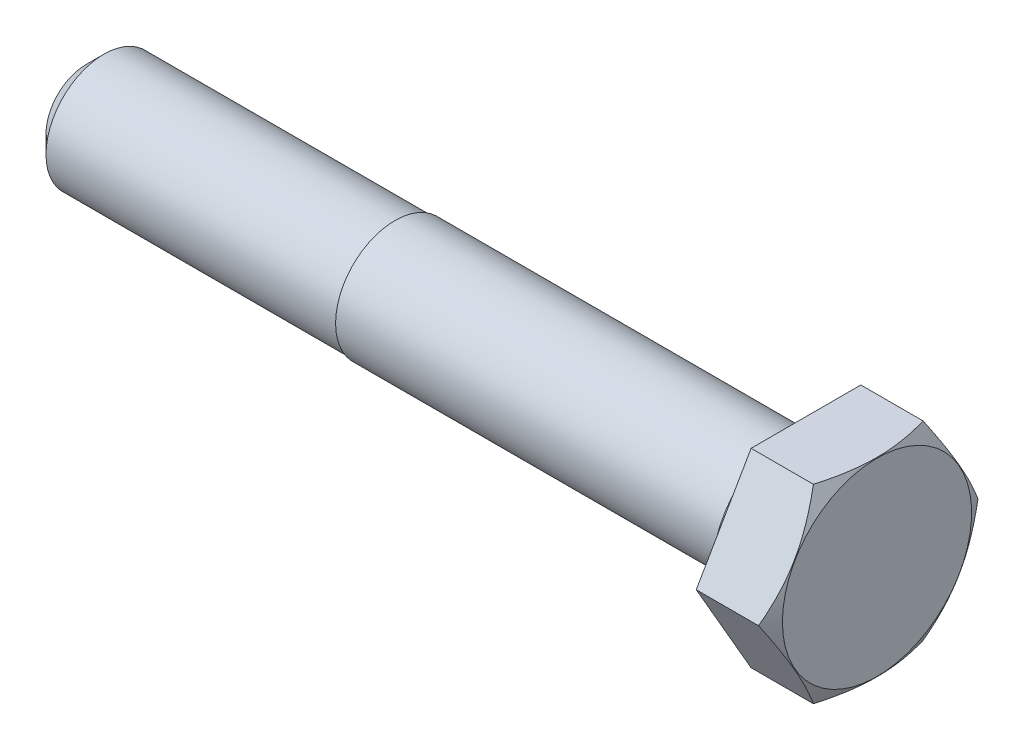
ISO-10303-21;
HEADER;
FILE_DESCRIPTION(('STEP AP214'),'2;1');
FILE_NAME('part.step','',(''),(''),'','','');
FILE_SCHEMA(('AUTOMOTIVE_DESIGN { 1 0 10303 214 1 1 1 1 }'));
ENDSEC;
DATA;
#1=APPLICATION_CONTEXT('core data for automotive mechanical design processes');
#2=APPLICATION_PROTOCOL_DEFINITION('international standard','automotive_design',2000,#1);
#3=PRODUCT_CONTEXT('',#1,'mechanical');
#4=PRODUCT('Part','Part','',(#3));
#5=PRODUCT_RELATED_PRODUCT_CATEGORY('part','',(#4));
#6=PRODUCT_DEFINITION_FORMATION('','',#4);
#7=PRODUCT_DEFINITION_CONTEXT('part definition',#1,'design');
#8=PRODUCT_DEFINITION('design','',#6,#7);
#9=PRODUCT_DEFINITION_SHAPE('','',#8);
#10=(LENGTH_UNIT() NAMED_UNIT(*) SI_UNIT(.MILLI.,.METRE.));
#11=(NAMED_UNIT(*) PLANE_ANGLE_UNIT() SI_UNIT($,.RADIAN.));
#12=(NAMED_UNIT(*) SI_UNIT($,.STERADIAN.) SOLID_ANGLE_UNIT());
#13=UNCERTAINTY_MEASURE_WITH_UNIT(LENGTH_MEASURE(1.E-05),#10,'distance_accuracy_value','');
#14=(GEOMETRIC_REPRESENTATION_CONTEXT(3) GLOBAL_UNCERTAINTY_ASSIGNED_CONTEXT((#13)) GLOBAL_UNIT_ASSIGNED_CONTEXT((#10,
#11,#12)) REPRESENTATION_CONTEXT('',''));
#15=CARTESIAN_POINT('',(0.,0.,0.));
#16=DIRECTION('',(0.,0.,1.));
#17=DIRECTION('',(1.,0.,0.));
#18=AXIS2_PLACEMENT_3D('',#15,#16,#17);
#19=CARTESIAN_POINT('',(6.58,0.,0.));
#20=DIRECTION('',(1.,0.,0.));
#21=DIRECTION('',(0.,0.,-1.));
#22=AXIS2_PLACEMENT_3D('',#19,#20,#21);
#23=PLANE('',#22);
#24=CARTESIAN_POINT('',(6.58000000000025,0.,0.));
#25=DIRECTION('',(-1.,0.,0.));
#26=DIRECTION('',(0.,0.,1.));
#27=AXIS2_PLACEMENT_3D('',#24,#25,#26);
#28=CIRCLE('',#27,7.96416127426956);
#29=CARTESIAN_POINT('',(6.58000000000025,0.,7.96416127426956));
#30=VERTEX_POINT('',#29);
#31=EDGE_CURVE('E96',#30,#30,#28,.T.);
#32=ORIENTED_EDGE('',*,*,#31,.F.);
#33=EDGE_LOOP('',(#32));
#34=FACE_BOUND('',#33,.T.);
#35=ADVANCED_FACE('F16',(#34),#23,.T.);
#36=CARTESIAN_POINT('',(5.84036598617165,0.,0.));
#37=DIRECTION('',(-1.,0.,0.));
#38=DIRECTION('',(0.,0.,1.));
#39=AXIS2_PLACEMENT_3D('',#36,#37,#38);
#40=CONICAL_SURFACE('',#39,9.24524496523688,1.0471975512);
#41=ORIENTED_EDGE('',*,*,#31,.T.);
#42=EDGE_LOOP('',(#41));
#43=FACE_BOUND('',#42,.T.);
#44=CARTESIAN_POINT('',(5.84477732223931,-1.71278036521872E-12,-9.23760430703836));
#45=CARTESIAN_POINT('',(5.94979165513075,-0.315055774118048,-9.05570677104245));
#46=CARTESIAN_POINT('',(6.04630304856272,-0.632460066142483,-8.87245331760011));
#47=CARTESIAN_POINT('',(6.21805198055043,-1.27221617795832,-8.50308995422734));
#48=CARTESIAN_POINT('',(6.29324487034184,-1.59457691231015,-8.31697489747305));
#49=CARTESIAN_POINT('',(6.41622401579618,-2.2359286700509,-7.946690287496));
#50=CARTESIAN_POINT('',(6.46458569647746,-2.5548337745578,-7.76257033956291));
#51=CARTESIAN_POINT('',(6.51588451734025,-3.03469904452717,-7.48551999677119));
#52=CARTESIAN_POINT('',(6.52944237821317,-3.19484385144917,-7.39306034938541));
#53=CARTESIAN_POINT('',(6.5492482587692,-3.51546832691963,-7.20794772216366));
#54=CARTESIAN_POINT('',(6.55549683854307,-3.67594796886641,-7.11529475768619));
#55=CARTESIAN_POINT('',(6.56075664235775,-4.0103014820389,-6.92225566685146));
#56=CARTESIAN_POINT('',(6.55912510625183,-4.18418310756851,-6.82186506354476));
#57=CARTESIAN_POINT('',(6.54717075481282,-4.53172322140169,-6.62121268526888));
#58=CARTESIAN_POINT('',(6.53684775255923,-4.70538170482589,-6.5209509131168));
#59=CARTESIAN_POINT('',(6.50774077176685,-5.05235452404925,-6.32062606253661));
#60=CARTESIAN_POINT('',(6.48894759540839,-5.22566827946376,-6.22056331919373));
#61=CARTESIAN_POINT('',(6.44332878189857,-5.57150185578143,-6.0208962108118));
#62=CARTESIAN_POINT('',(6.41650247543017,-5.74402160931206,-5.92129188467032));
#63=CARTESIAN_POINT('',(6.32328511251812,-6.26854051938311,-5.6184607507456));
#64=CARTESIAN_POINT('',(6.24490938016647,-6.61898300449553,-5.41613268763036));
#65=CARTESIAN_POINT('',(6.10811478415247,-7.14030011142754,-5.11515011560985));
#66=CARTESIAN_POINT('',(6.05937070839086,-7.31317449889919,-5.01534104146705));
#67=CARTESIAN_POINT('',(5.95617990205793,-7.65757214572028,-4.81650296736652));
#68=CARTESIAN_POINT('',(5.90173542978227,-7.82909591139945,-4.71747367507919));
#69=CARTESIAN_POINT('',(5.84477732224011,-8.00000000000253,-4.61880215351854));
#70=B_SPLINE_CURVE_WITH_KNOTS('',3,(#44,#45,#46,#47,#48,#49,#50,#51,#52,#53,#54,#55,#56,#57,#58,
#59,#60,#61,#62,#63,#64,#65,#66,#67,#68,#69),.UNSPECIFIED.,.F.,.F.,(4,2,2,2,2,2,2,2,2,2,2,2,4),
(0.,1.13620772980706,2.2747778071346,3.38787966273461,3.94400525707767,4.50008823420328,
5.10225977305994,5.70444426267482,6.30728424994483,6.910174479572,8.14546238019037,
8.76185434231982,9.37800302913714),.UNSPECIFIED.);
#71=CARTESIAN_POINT('',(5.84477732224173,-8.53704943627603E-13,-9.23760430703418));
#72=VERTEX_POINT('',#71);
#73=CARTESIAN_POINT('',(5.84477732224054,-8.,-4.61880215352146));
#74=VERTEX_POINT('',#73);
#75=EDGE_CURVE('E137',#72,#74,#70,.T.);
#76=ORIENTED_EDGE('',*,*,#75,.F.);
#77=CARTESIAN_POINT('',(5.84477732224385,7.99999999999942,-4.61880215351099));
#78=CARTESIAN_POINT('',(5.90338169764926,7.82415290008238,-4.72032752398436));
#79=CARTESIAN_POINT('',(5.95932618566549,7.64765018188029,-4.82223141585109));
#80=CARTESIAN_POINT('',(6.06516280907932,7.29321133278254,-5.02686678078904));
#81=CARTESIAN_POINT('',(6.11505233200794,7.11527461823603,-5.12959859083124));
#82=CARTESIAN_POINT('',(6.25465902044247,6.57861566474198,-5.43943878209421));
#83=CARTESIAN_POINT('',(6.33406438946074,6.21777505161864,-5.64777020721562));
#84=CARTESIAN_POINT('',(6.42717459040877,5.67778408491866,-5.95953413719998));
#85=CARTESIAN_POINT('',(6.45369860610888,5.50024680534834,-6.06203533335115));
#86=CARTESIAN_POINT('',(6.4981739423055,5.14436946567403,-6.2675012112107));
#87=CARTESIAN_POINT('',(6.51612602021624,4.96602947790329,-6.37046585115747));
#88=CARTESIAN_POINT('',(6.54300251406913,4.60904251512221,-6.57657237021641));
#89=CARTESIAN_POINT('',(6.55193717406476,4.43039611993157,-6.67971391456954));
#90=CARTESIAN_POINT('',(6.56058729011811,4.0729384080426,-6.88609222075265));
#91=CARTESIAN_POINT('',(6.56030303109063,3.89412709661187,-6.98932897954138));
#92=CARTESIAN_POINT('',(6.55115729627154,3.55984569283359,-7.18232643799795));
#93=CARTESIAN_POINT('',(6.54341147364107,3.40435198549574,-7.2721007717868));
#94=CARTESIAN_POINT('',(6.52109880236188,3.09372877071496,-7.45143916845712));
#95=CARTESIAN_POINT('',(6.50653149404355,2.93859928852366,-7.54100321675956));
#96=CARTESIAN_POINT('',(6.45294161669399,2.47381144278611,-7.80934860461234));
#97=CARTESIAN_POINT('',(6.40403778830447,2.16497575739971,-7.98765497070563));
#98=CARTESIAN_POINT('',(6.28177990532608,1.54402881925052,-8.34615885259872));
#99=CARTESIAN_POINT('',(6.20790770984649,1.23199679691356,-8.52631062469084));
#100=CARTESIAN_POINT('',(6.0402493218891,0.612585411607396,-8.88392795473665));
#101=CARTESIAN_POINT('',(5.94650249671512,0.3051981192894,-9.06139809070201));
#102=CARTESIAN_POINT('',(5.84477732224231,-5.49950815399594E-12,-9.23760430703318));
#103=B_SPLINE_CURVE_WITH_KNOTS('',3,(#77,#78,#79,#80,#81,#82,#83,#84,#85,#86,#87,#88,#89,#90,
#91,#92,#93,#94,#95,#96,#97,#98,#99,#100,#101,#102),.UNSPECIFIED.,.F.,.F.,(4,2,2,2,2,2,2,2,2,2,
2,2,4),(0.,0.633965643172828,1.26820385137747,2.5393150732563,3.15930423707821,3.77923860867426,
4.39846792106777,5.01767809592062,5.55669078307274,6.09573979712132,7.17460544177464,
8.27739515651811,9.37802056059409),.UNSPECIFIED.);
#104=CARTESIAN_POINT('',(5.84477732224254,7.99999999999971,-4.61880215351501));
#105=VERTEX_POINT('',#104);
#106=EDGE_CURVE('E92',#105,#72,#103,.T.);
#107=ORIENTED_EDGE('',*,*,#106,.F.);
#108=CARTESIAN_POINT('',(5.84477732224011,8.,4.61880215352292));
#109=CARTESIAN_POINT('',(5.90338169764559,8.,4.41575141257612));
#110=CARTESIAN_POINT('',(5.95932618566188,8.,4.21194362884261));
#111=CARTESIAN_POINT('',(6.06516280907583,8.,3.8026728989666));
#112=CARTESIAN_POINT('',(6.11505233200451,8.,3.59720927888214));
#113=CARTESIAN_POINT('',(6.25465902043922,8.,2.97752889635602));
#114=CARTESIAN_POINT('',(6.33406438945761,8.,2.56086604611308));
#115=CARTESIAN_POINT('',(6.4271745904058,8.,1.93733818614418));
#116=CARTESIAN_POINT('',(6.45369860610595,8.,1.73233579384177));
#117=CARTESIAN_POINT('',(6.49817394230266,8.,1.32140403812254));
#118=CARTESIAN_POINT('',(6.51612602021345,8.,1.11547475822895));
#119=CARTESIAN_POINT('',(6.54300251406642,8.,0.703261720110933));
#120=CARTESIAN_POINT('',(6.55193717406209,8.,0.496978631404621));
#121=CARTESIAN_POINT('',(6.5605872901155,8.,0.0842220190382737));
#122=CARTESIAN_POINT('',(6.56030303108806,8.,-0.12225149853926));
#123=CARTESIAN_POINT('',(6.55115729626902,8.,-0.508246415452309));
#124=CARTESIAN_POINT('',(6.54341147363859,8.,-0.687795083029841));
#125=CARTESIAN_POINT('',(6.52109880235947,8.,-1.04647187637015));
#126=CARTESIAN_POINT('',(6.50653149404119,8.,-1.22559997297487));
#127=CARTESIAN_POINT('',(6.45294161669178,8.,-1.76229074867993));
#128=CARTESIAN_POINT('',(6.40403778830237,8.,-2.11890348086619));
#129=CARTESIAN_POINT('',(6.28177990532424,8.,-2.83591124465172));
#130=CARTESIAN_POINT('',(6.2079077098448,8.,-3.19621478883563));
#131=CARTESIAN_POINT('',(6.04024932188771,8.,-3.91144944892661));
#132=CARTESIAN_POINT('',(5.94650249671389,8.,-4.26638972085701));
#133=CARTESIAN_POINT('',(5.84477732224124,8.,-4.61880215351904));
#134=B_SPLINE_CURVE_WITH_KNOTS('',3,(#108,#109,#110,#111,#112,#113,#114,#115,#116,#117,#118,
#119,#120,#121,#122,#123,#124,#125,#126,#127,#128,#129,#130,#131,#132,#133),.UNSPECIFIED.,.F.,
.F.,(4,2,2,2,2,2,2,2,2,2,2,2,4),(0.,0.633965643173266,1.26820385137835,2.53931507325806,
3.15930423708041,3.77923860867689,4.39846792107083,5.01767809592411,5.55669078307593,
6.09573979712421,7.17460544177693,8.27739515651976,9.3780205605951),.UNSPECIFIED.);
#135=CARTESIAN_POINT('',(5.84477732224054,8.,4.61880215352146));
#136=VERTEX_POINT('',#135);
#137=EDGE_CURVE('E85',#136,#105,#134,.T.);
#138=ORIENTED_EDGE('',*,*,#137,.F.);
#139=CARTESIAN_POINT('',(5.84477732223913,1.15719547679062E-12,9.23760430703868));
#140=CARTESIAN_POINT('',(5.94979165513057,0.315055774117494,9.05570677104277));
#141=CARTESIAN_POINT('',(6.04630304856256,0.632460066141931,8.87245331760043));
#142=CARTESIAN_POINT('',(6.2180519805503,1.27221617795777,8.50308995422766));
#143=CARTESIAN_POINT('',(6.29324487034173,1.59457691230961,8.31697489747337));
#144=CARTESIAN_POINT('',(6.41622401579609,2.23592867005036,7.94669028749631));
#145=CARTESIAN_POINT('',(6.46458569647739,2.55483377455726,7.76257033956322));
#146=CARTESIAN_POINT('',(6.5158845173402,3.03469904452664,7.4855199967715));
#147=CARTESIAN_POINT('',(6.52944237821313,3.19484385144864,7.39306034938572));
#148=CARTESIAN_POINT('',(6.54924825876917,3.51546832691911,7.20794772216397));
#149=CARTESIAN_POINT('',(6.55549683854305,3.67594796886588,7.1152947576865));
#150=CARTESIAN_POINT('',(6.56075664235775,4.0103014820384,6.92225566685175));
#151=CARTESIAN_POINT('',(6.55912510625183,4.18418310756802,6.82186506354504));
#152=CARTESIAN_POINT('',(6.54717075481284,4.53172322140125,6.62121268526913));
#153=CARTESIAN_POINT('',(6.53684775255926,4.70538170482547,6.52095091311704));
#154=CARTESIAN_POINT('',(6.50774077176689,5.05235452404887,6.32062606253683));
#155=CARTESIAN_POINT('',(6.48894759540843,5.2256682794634,6.22056331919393));
#156=CARTESIAN_POINT('',(6.44332878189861,5.57150185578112,6.02089621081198));
#157=CARTESIAN_POINT('',(6.41650247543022,5.74402160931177,5.92129188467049));
#158=CARTESIAN_POINT('',(6.32328511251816,6.26854051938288,5.61846075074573));
#159=CARTESIAN_POINT('',(6.24490938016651,6.61898300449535,5.41613268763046));
#160=CARTESIAN_POINT('',(6.1081147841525,7.14030011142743,5.11515011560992));
#161=CARTESIAN_POINT('',(6.05937070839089,7.31317449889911,5.0153410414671));
#162=CARTESIAN_POINT('',(5.95617990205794,7.65757214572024,4.81650296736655));
#163=CARTESIAN_POINT('',(5.90173542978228,7.82909591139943,4.7174736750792));
#164=CARTESIAN_POINT('',(5.84477732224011,8.00000000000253,4.61880215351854));
#165=B_SPLINE_CURVE_WITH_KNOTS('',3,(#139,#140,#141,#142,#143,#144,#145,#146,#147,#148,#149,
#150,#151,#152,#153,#154,#155,#156,#157,#158,#159,#160,#161,#162,#163,#164),.UNSPECIFIED.,.F.,
.F.,(4,2,2,2,2,2,2,2,2,2,2,2,4),(0.,1.13620772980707,2.27477780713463,3.38787966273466,
3.94400525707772,4.50008823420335,5.10225977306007,5.70444426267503,6.30728424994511,
6.91017447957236,8.14546238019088,8.76185434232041,9.37800302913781),.UNSPECIFIED.);
#166=CARTESIAN_POINT('',(5.84477732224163,5.7958640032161E-13,9.23760430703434));
#167=VERTEX_POINT('',#166);
#168=EDGE_CURVE('E89',#167,#136,#165,.T.);
#169=ORIENTED_EDGE('',*,*,#168,.F.);
#170=CARTESIAN_POINT('',(5.84477732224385,-7.99999999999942,4.61880215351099));
#171=CARTESIAN_POINT('',(5.90338169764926,-7.82415290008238,4.72032752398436));
#172=CARTESIAN_POINT('',(5.95932618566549,-7.64765018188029,4.82223141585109));
#173=CARTESIAN_POINT('',(6.06516280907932,-7.29321133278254,5.02686678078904));
#174=CARTESIAN_POINT('',(6.11505233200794,-7.11527461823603,5.12959859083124));
#175=CARTESIAN_POINT('',(6.25465902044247,-6.57861566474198,5.43943878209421));
#176=CARTESIAN_POINT('',(6.33406438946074,-6.21777505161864,5.64777020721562));
#177=CARTESIAN_POINT('',(6.42717459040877,-5.67778408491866,5.95953413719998));
#178=CARTESIAN_POINT('',(6.45369860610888,-5.50024680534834,6.06203533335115));
#179=CARTESIAN_POINT('',(6.4981739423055,-5.14436946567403,6.2675012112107));
#180=CARTESIAN_POINT('',(6.51612602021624,-4.96602947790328,6.37046585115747));
#181=CARTESIAN_POINT('',(6.54300251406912,-4.60904251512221,6.57657237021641));
#182=CARTESIAN_POINT('',(6.55193717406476,-4.43039611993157,6.67971391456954));
#183=CARTESIAN_POINT('',(6.56058729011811,-4.0729384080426,6.88609222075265));
#184=CARTESIAN_POINT('',(6.56030303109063,-3.89412709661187,6.98932897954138));
#185=CARTESIAN_POINT('',(6.55115729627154,-3.55984569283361,7.18232643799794));
#186=CARTESIAN_POINT('',(6.54341147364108,-3.40435198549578,7.27210077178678));
#187=CARTESIAN_POINT('',(6.52109880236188,-3.09372877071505,7.45143916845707));
#188=CARTESIAN_POINT('',(6.50653149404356,-2.93859928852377,7.5410032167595));
#189=CARTESIAN_POINT('',(6.45294161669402,-2.4738114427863,7.80934860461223));
#190=CARTESIAN_POINT('',(6.40403778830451,-2.16497575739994,7.9876549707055));
#191=CARTESIAN_POINT('',(6.28177990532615,-1.54402881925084,8.34615885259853));
#192=CARTESIAN_POINT('',(6.20790770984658,-1.23199679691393,8.52631062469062));
#193=CARTESIAN_POINT('',(6.04024932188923,-0.612585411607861,8.88392795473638));
#194=CARTESIAN_POINT('',(5.94650249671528,-0.305198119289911,9.06139809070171));
#195=CARTESIAN_POINT('',(5.84477732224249,4.94435617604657E-12,9.23760430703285));
#196=B_SPLINE_CURVE_WITH_KNOTS('',3,(#170,#171,#172,#173,#174,#175,#176,#177,#178,#179,#180,
#181,#182,#183,#184,#185,#186,#187,#188,#189,#190,#191,#192,#193,#194,#195),.UNSPECIFIED.,.F.,
.F.,(4,2,2,2,2,2,2,2,2,2,2,2,4),(0.,0.633965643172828,1.26820385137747,2.5393150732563,
3.15930423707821,3.77923860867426,4.39846792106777,5.01767809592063,5.55669078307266,
6.09573979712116,7.17460544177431,8.27739515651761,9.37802056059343),.UNSPECIFIED.);
#197=CARTESIAN_POINT('',(5.8447773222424,-7.99999999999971,4.6188021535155));
#198=VERTEX_POINT('',#197);
#199=EDGE_CURVE('E110',#198,#167,#196,.T.);
#200=ORIENTED_EDGE('',*,*,#199,.F.);
#201=CARTESIAN_POINT('',(5.84477732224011,-8.,-4.61880215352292));
#202=CARTESIAN_POINT('',(5.90338169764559,-8.,-4.41575141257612));
#203=CARTESIAN_POINT('',(5.95932618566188,-8.,-4.21194362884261));
#204=CARTESIAN_POINT('',(6.06516280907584,-8.,-3.8026728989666));
#205=CARTESIAN_POINT('',(6.11505233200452,-8.,-3.59720927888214));
#206=CARTESIAN_POINT('',(6.25465902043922,-8.,-2.97752889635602));
#207=CARTESIAN_POINT('',(6.33406438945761,-8.,-2.56086604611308));
#208=CARTESIAN_POINT('',(6.4271745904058,-8.,-1.93733818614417));
#209=CARTESIAN_POINT('',(6.45369860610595,-8.,-1.73233579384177));
#210=CARTESIAN_POINT('',(6.49817394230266,-8.,-1.32140403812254));
#211=CARTESIAN_POINT('',(6.51612602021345,-8.,-1.11547475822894));
#212=CARTESIAN_POINT('',(6.54300251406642,-8.,-0.703261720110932));
#213=CARTESIAN_POINT('',(6.55193717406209,-8.,-0.49697863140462));
#214=CARTESIAN_POINT('',(6.5605872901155,-8.,-0.0842220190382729));
#215=CARTESIAN_POINT('',(6.56030303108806,-8.,0.122251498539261));
#216=CARTESIAN_POINT('',(6.55115729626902,-8.,0.508246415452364));
#217=CARTESIAN_POINT('',(6.54341147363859,-8.,0.687795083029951));
#218=CARTESIAN_POINT('',(6.52109880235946,-8.,1.04647187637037));
#219=CARTESIAN_POINT('',(6.50653149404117,-8.,1.22559997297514));
#220=CARTESIAN_POINT('',(6.45294161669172,-8.,1.76229074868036));
#221=CARTESIAN_POINT('',(6.4040377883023,-8.,2.11890348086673));
#222=CARTESIAN_POINT('',(6.2817799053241,-8.,2.83591124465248));
#223=CARTESIAN_POINT('',(6.20790770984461,-8.,3.1962147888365));
#224=CARTESIAN_POINT('',(6.04024932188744,-8.,3.9114494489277));
#225=CARTESIAN_POINT('',(5.94650249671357,-8.,4.2663897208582));
#226=CARTESIAN_POINT('',(5.84477732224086,-8.,4.61880215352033));
#227=B_SPLINE_CURVE_WITH_KNOTS('',3,(#201,#202,#203,#204,#205,#206,#207,#208,#209,#210,#211,
#212,#213,#214,#215,#216,#217,#218,#219,#220,#221,#222,#223,#224,#225,#226),.UNSPECIFIED.,.F.,
.F.,(4,2,2,2,2,2,2,2,2,2,2,2,4),(0.,0.633965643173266,1.26820385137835,2.53931507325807,
3.15930423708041,3.77923860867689,4.39846792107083,5.01767809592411,5.55669078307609,
6.09573979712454,7.17460544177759,8.27739515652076,9.37802056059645),.UNSPECIFIED.);
#228=EDGE_CURVE('E144',#74,#198,#227,.T.);
#229=ORIENTED_EDGE('',*,*,#228,.F.);
#230=EDGE_LOOP('',(#76,#107,#138,#169,#200,#229));
#231=FACE_BOUND('',#230,.T.);
#232=ADVANCED_FACE('F87',(#43,#231),#40,.T.);
#233=CARTESIAN_POINT('',(0.6,8.,-4.61880215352));
#234=DIRECTION('',(0.,1.,0.));
#235=DIRECTION('',(0.,0.,1.));
#236=AXIS2_PLACEMENT_3D('',#233,#234,#235);
#237=PLANE('',#236);
#238=DIRECTION('',(1.,0.,0.));
#239=VECTOR('',#238,1.);
#240=CARTESIAN_POINT('',(0.6,8.,4.61880215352));
#241=LINE('',#240,#239);
#242=CARTESIAN_POINT('',(0.6,8.,4.61880215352));
#243=VERTEX_POINT('',#242);
#244=EDGE_CURVE('E95',#136,#243,#241,.F.);
#245=ORIENTED_EDGE('',*,*,#244,.F.);
#246=ORIENTED_EDGE('',*,*,#137,.T.);
#247=DIRECTION('',(1.,0.,0.));
#248=VECTOR('',#247,1.);
#249=CARTESIAN_POINT('',(0.6,7.99999999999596,-4.61880215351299));
#250=LINE('',#249,#248);
#251=CARTESIAN_POINT('',(0.6,7.99999999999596,-4.61880215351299));
#252=VERTEX_POINT('',#251);
#253=EDGE_CURVE('E154',#252,#105,#250,.T.);
#254=ORIENTED_EDGE('',*,*,#253,.F.);
#255=DIRECTION('',(0.,0.,-1.));
#256=VECTOR('',#255,1.);
#257=CARTESIAN_POINT('',(0.6,8.,0.));
#258=LINE('',#257,#256);
#259=EDGE_CURVE('E101',#252,#243,#258,.F.);
#260=ORIENTED_EDGE('',*,*,#259,.T.);
#261=EDGE_LOOP('',(#245,#246,#254,#260));
#262=FACE_BOUND('',#261,.T.);
#263=ADVANCED_FACE('F99',(#262),#237,.T.);
#264=CARTESIAN_POINT('',(0.6,8.,4.61880215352));
#265=DIRECTION('',(0.,0.50000000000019,0.866025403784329));
#266=DIRECTION('',(0.,-0.866025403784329,0.50000000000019));
#267=AXIS2_PLACEMENT_3D('',#264,#265,#266);
#268=PLANE('',#267);
#269=DIRECTION('',(1.,0.,0.));
#270=VECTOR('',#269,1.);
#271=CARTESIAN_POINT('',(0.6,0.,9.23760430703));
#272=LINE('',#271,#270);
#273=CARTESIAN_POINT('',(0.6,1.51894184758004E-12,9.23760430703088));
#274=VERTEX_POINT('',#273);
#275=EDGE_CURVE('E107',#167,#274,#272,.F.);
#276=ORIENTED_EDGE('',*,*,#275,.F.);
#277=ORIENTED_EDGE('',*,*,#168,.T.);
#278=ORIENTED_EDGE('',*,*,#244,.T.);
#279=DIRECTION('',(0.,-0.866025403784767,0.499999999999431));
#280=VECTOR('',#279,1.);
#281=CARTESIAN_POINT('',(0.6,8.,4.61880215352));
#282=LINE('',#281,#280);
#283=EDGE_CURVE('E287',#243,#274,#282,.T.);
#284=ORIENTED_EDGE('',*,*,#283,.T.);
#285=EDGE_LOOP('',(#276,#277,#278,#284));
#286=FACE_BOUND('',#285,.T.);
#287=ADVANCED_FACE('F105',(#286),#268,.T.);
#288=CARTESIAN_POINT('',(0.6,0.,9.23760430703));
#289=DIRECTION('',(0.,-0.50000000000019,0.866025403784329));
#290=DIRECTION('',(0.,-0.866025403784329,-0.50000000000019));
#291=AXIS2_PLACEMENT_3D('',#288,#289,#290);
#292=PLANE('',#291);
#293=DIRECTION('',(1.,0.,0.));
#294=VECTOR('',#293,1.);
#295=CARTESIAN_POINT('',(0.6,-8.,4.61880215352));
#296=LINE('',#295,#294);
#297=CARTESIAN_POINT('',(0.6,-8.,4.61880215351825));
#298=VERTEX_POINT('',#297);
#299=EDGE_CURVE('E271',#198,#298,#296,.F.);
#300=ORIENTED_EDGE('',*,*,#299,.F.);
#301=ORIENTED_EDGE('',*,*,#199,.T.);
#302=ORIENTED_EDGE('',*,*,#275,.T.);
#303=DIRECTION('',(0.,-0.866025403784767,-0.499999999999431));
#304=VECTOR('',#303,1.);
#305=CARTESIAN_POINT('',(0.6,0.,9.23760430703));
#306=LINE('',#305,#304);
#307=EDGE_CURVE('E295',#274,#298,#306,.T.);
#308=ORIENTED_EDGE('',*,*,#307,.T.);
#309=EDGE_LOOP('',(#300,#301,#302,#308));
#310=FACE_BOUND('',#309,.T.);
#311=ADVANCED_FACE('F171',(#310),#292,.T.);
#312=CARTESIAN_POINT('',(0.6,-8.,4.61880215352));
#313=DIRECTION('',(0.,-1.,0.));
#314=DIRECTION('',(0.,0.,-1.));
#315=AXIS2_PLACEMENT_3D('',#312,#313,#314);
#316=PLANE('',#315);
#317=DIRECTION('',(1.,0.,0.));
#318=VECTOR('',#317,1.);
#319=CARTESIAN_POINT('',(0.6,-8.,-4.61880215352));
#320=LINE('',#319,#318);
#321=CARTESIAN_POINT('',(0.6,-8.,-4.61880215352));
#322=VERTEX_POINT('',#321);
#323=EDGE_CURVE('E266',#74,#322,#320,.F.);
#324=ORIENTED_EDGE('',*,*,#323,.F.);
#325=ORIENTED_EDGE('',*,*,#228,.T.);
#326=ORIENTED_EDGE('',*,*,#299,.T.);
#327=DIRECTION('',(0.,0.,-1.));
#328=VECTOR('',#327,1.);
#329=CARTESIAN_POINT('',(0.6,-8.,0.));
#330=LINE('',#329,#328);
#331=EDGE_CURVE('E291',#298,#322,#330,.T.);
#332=ORIENTED_EDGE('',*,*,#331,.T.);
#333=EDGE_LOOP('',(#324,#325,#326,#332));
#334=FACE_BOUND('',#333,.T.);
#335=ADVANCED_FACE('F167',(#334),#316,.T.);
#336=CARTESIAN_POINT('',(0.6,-8.,-4.61880215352));
#337=DIRECTION('',(0.,-0.50000000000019,-0.866025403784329));
#338=DIRECTION('',(0.,0.866025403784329,-0.50000000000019));
#339=AXIS2_PLACEMENT_3D('',#336,#337,#338);
#340=PLANE('',#339);
#341=DIRECTION('',(1.,0.,0.));
#342=VECTOR('',#341,1.);
#343=CARTESIAN_POINT('',(0.6,0.,-9.23760430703));
#344=LINE('',#343,#342);
#345=CARTESIAN_POINT('',(0.6,-1.51257229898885E-12,-9.23760430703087));
#346=VERTEX_POINT('',#345);
#347=EDGE_CURVE('E259',#72,#346,#344,.F.);
#348=ORIENTED_EDGE('',*,*,#347,.F.);
#349=ORIENTED_EDGE('',*,*,#75,.T.);
#350=ORIENTED_EDGE('',*,*,#323,.T.);
#351=DIRECTION('',(0.,0.866025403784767,-0.499999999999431));
#352=VECTOR('',#351,1.);
#353=CARTESIAN_POINT('',(0.6,-8.,-4.61880215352));
#354=LINE('',#353,#352);
#355=EDGE_CURVE('E283',#322,#346,#354,.T.);
#356=ORIENTED_EDGE('',*,*,#355,.T.);
#357=EDGE_LOOP('',(#348,#349,#350,#356));
#358=FACE_BOUND('',#357,.T.);
#359=ADVANCED_FACE('F162',(#358),#340,.T.);
#360=CARTESIAN_POINT('',(0.6,0.,-9.23760430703));
#361=DIRECTION('',(0.,0.50000000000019,-0.866025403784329));
#362=DIRECTION('',(0.,0.866025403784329,0.50000000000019));
#363=AXIS2_PLACEMENT_3D('',#360,#361,#362);
#364=PLANE('',#363);
#365=ORIENTED_EDGE('',*,*,#253,.T.);
#366=ORIENTED_EDGE('',*,*,#106,.T.);
#367=ORIENTED_EDGE('',*,*,#347,.T.);
#368=DIRECTION('',(0.,0.866025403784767,0.499999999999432));
#369=VECTOR('',#368,1.);
#370=CARTESIAN_POINT('',(0.6,0.,-9.23760430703));
#371=LINE('',#370,#369);
#372=EDGE_CURVE('E280',#346,#252,#371,.T.);
#373=ORIENTED_EDGE('',*,*,#372,.T.);
#374=EDGE_LOOP('',(#365,#366,#367,#373));
#375=FACE_BOUND('',#374,.T.);
#376=ADVANCED_FACE('F157',(#375),#364,.T.);
#377=CARTESIAN_POINT('',(-60.,0.,0.));
#378=DIRECTION('',(-1.,0.,0.));
#379=DIRECTION('',(0.,0.,1.));
#380=AXIS2_PLACEMENT_3D('',#377,#378,#379);
#381=PLANE('',#380);
#382=CARTESIAN_POINT('',(-59.9999999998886,0.,0.));
#383=DIRECTION('',(1.,0.,0.));
#384=DIRECTION('',(0.,0.,-1.));
#385=AXIS2_PLACEMENT_3D('',#382,#383,#384);
#386=CIRCLE('',#385,3.37804878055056);
#387=CARTESIAN_POINT('',(-59.9999999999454,-3.37804878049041,-1.58731601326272E-11));
#388=VERTEX_POINT('',#387);
#389=CARTESIAN_POINT('',(-59.9999999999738,3.37804878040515,1.40288334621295E-13));
#390=VERTEX_POINT('',#389);
#391=EDGE_CURVE('E250',#388,#390,#386,.T.);
#392=ORIENTED_EDGE('',*,*,#391,.F.);
#393=CARTESIAN_POINT('',(-60.0000000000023,0.,0.));
#394=DIRECTION('',(1.,0.,0.));
#395=DIRECTION('',(0.,0.,-1.));
#396=AXIS2_PLACEMENT_3D('',#393,#394,#395);
#397=CIRCLE('',#396,3.37804878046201);
#398=EDGE_CURVE('E155',#390,#388,#397,.T.);
#399=ORIENTED_EDGE('',*,*,#398,.F.);
#400=EDGE_LOOP('',(#392,#399));
#401=FACE_BOUND('',#400,.T.);
#402=ADVANCED_FACE('F161',(#401),#381,.T.);
#403=CARTESIAN_POINT('',(0.6,0.,0.));
#404=DIRECTION('',(1.,0.,0.));
#405=DIRECTION('',(0.,0.,-1.));
#406=AXIS2_PLACEMENT_3D('',#403,#404,#405);
#407=PLANE('',#406);
#408=CARTESIAN_POINT('',(0.6,0.,0.));
#409=DIRECTION('',(1.,0.,0.));
#410=DIRECTION('',(0.,0.,-1.));
#411=AXIS2_PLACEMENT_3D('',#408,#409,#410);
#412=CIRCLE('',#411,7.315);
#413=CARTESIAN_POINT('',(0.6,0.,-7.315));
#414=VERTEX_POINT('',#413);
#415=EDGE_CURVE('E239',#414,#414,#412,.F.);
#416=ORIENTED_EDGE('',*,*,#415,.F.);
#417=EDGE_LOOP('',(#416));
#418=FACE_BOUND('',#417,.T.);
#419=ORIENTED_EDGE('',*,*,#355,.F.);
#420=ORIENTED_EDGE('',*,*,#331,.F.);
#421=ORIENTED_EDGE('',*,*,#307,.F.);
#422=ORIENTED_EDGE('',*,*,#283,.F.);
#423=ORIENTED_EDGE('',*,*,#259,.F.);
#424=ORIENTED_EDGE('',*,*,#372,.F.);
#425=EDGE_LOOP('',(#419,#420,#421,#422,#423,#424));
#426=FACE_BOUND('',#425,.T.);
#427=ADVANCED_FACE('F384',(#418,#426),#407,.F.);
#428=CARTESIAN_POINT('',(-58.5000000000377,0.,0.));
#429=DIRECTION('',(1.,0.,0.));
#430=DIRECTION('',(0.,0.,-1.));
#431=AXIS2_PLACEMENT_3D('',#428,#429,#430);
#432=CONICAL_SURFACE('',#431,4.87804878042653,0.785398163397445);
#433=DIRECTION('',(-0.707106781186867,-0.707106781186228,1.43621226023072E-12));
#434=VECTOR('',#433,1.);
#435=CARTESIAN_POINT('',(499000.000000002,499063.378048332,-1.01364604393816E-06));
#436=LINE('',#435,#434);
#437=CARTESIAN_POINT('',(-58.4999999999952,4.87804878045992,-1.08970504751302E-12));
#438=VERTEX_POINT('',#437);
#439=EDGE_CURVE('E251',#390,#438,#436,.F.);
#440=ORIENTED_EDGE('',*,*,#439,.F.);
#441=ORIENTED_EDGE('',*,*,#398,.T.);
#442=DIRECTION('',(-0.707106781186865,0.70710678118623,-1.37814759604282E-12));
#443=VECTOR('',#442,1.);
#444=CARTESIAN_POINT('',(499000.000000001,-499063.378048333,9.72649582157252E-07));
#445=LINE('',#444,#443);
#446=CARTESIAN_POINT('',(-58.5000000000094,-4.87804878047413,-3.23808896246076E-12));
#447=VERTEX_POINT('',#446);
#448=EDGE_CURVE('E247',#447,#388,#445,.T.);
#449=ORIENTED_EDGE('',*,*,#448,.F.);
#450=CARTESIAN_POINT('',(-58.5,0.,0.));
#451=DIRECTION('',(-1.,0.,0.));
#452=DIRECTION('',(0.,0.,1.));
#453=AXIS2_PLACEMENT_3D('',#450,#451,#452);
#454=CIRCLE('',#453,4.87804878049);
#455=EDGE_CURVE('E230',#438,#447,#454,.F.);
#456=ORIENTED_EDGE('',*,*,#455,.F.);
#457=EDGE_LOOP('',(#440,#441,#449,#456));
#458=FACE_BOUND('',#457,.T.);
#459=ADVANCED_FACE('F319',(#458),#432,.T.);
#460=CARTESIAN_POINT('',(-58.499999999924,0.,0.));
#461=DIRECTION('',(1.,0.,0.));
#462=DIRECTION('',(0.,0.,-1.));
#463=AXIS2_PLACEMENT_3D('',#460,#461,#462);
#464=CONICAL_SURFACE('',#463,4.8780487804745,0.785398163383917);
#465=ORIENTED_EDGE('',*,*,#448,.T.);
#466=ORIENTED_EDGE('',*,*,#391,.T.);
#467=ORIENTED_EDGE('',*,*,#439,.T.);
#468=CARTESIAN_POINT('',(-58.5,0.,0.));
#469=DIRECTION('',(-1.,0.,0.));
#470=DIRECTION('',(0.,0.,1.));
#471=AXIS2_PLACEMENT_3D('',#468,#469,#470);
#472=CIRCLE('',#471,4.87804878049);
#473=EDGE_CURVE('E238',#447,#438,#472,.F.);
#474=ORIENTED_EDGE('',*,*,#473,.F.);
#475=EDGE_LOOP('',(#465,#466,#467,#474));
#476=FACE_BOUND('',#475,.T.);
#477=ADVANCED_FACE('F314',(#476),#464,.T.);
#478=CARTESIAN_POINT('',(0.3,0.,0.));
#479=DIRECTION('',(1.,0.,0.));
#480=DIRECTION('',(0.,0.,-1.));
#481=AXIS2_PLACEMENT_3D('',#478,#479,#480);
#482=CYLINDRICAL_SURFACE('',#481,7.315);
#483=CARTESIAN_POINT('',(0.,0.,0.));
#484=DIRECTION('',(1.,0.,0.));
#485=DIRECTION('',(0.,0.,-1.));
#486=AXIS2_PLACEMENT_3D('',#483,#484,#485);
#487=CIRCLE('',#486,7.315);
#488=CARTESIAN_POINT('',(0.,0.,-7.315));
#489=VERTEX_POINT('',#488);
#490=EDGE_CURVE('E244',#489,#489,#487,.T.);
#491=ORIENTED_EDGE('',*,*,#490,.T.);
#492=EDGE_LOOP('',(#491));
#493=FACE_BOUND('',#492,.T.);
#494=ORIENTED_EDGE('',*,*,#415,.T.);
#495=EDGE_LOOP('',(#494));
#496=FACE_BOUND('',#495,.T.);
#497=ADVANCED_FACE('F322',(#493,#496),#482,.T.);
#498=CARTESIAN_POINT('',(-47.,0.,0.));
#499=DIRECTION('',(-1.,0.,0.));
#500=DIRECTION('',(0.,0.,1.));
#501=AXIS2_PLACEMENT_3D('',#498,#499,#500);
#502=CYLINDRICAL_SURFACE('',#501,4.87804878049);
#503=CARTESIAN_POINT('',(-34.,0.,0.));
#504=DIRECTION('',(-1.,0.,0.));
#505=DIRECTION('',(0.,0.,1.));
#506=AXIS2_PLACEMENT_3D('',#503,#504,#505);
#507=CIRCLE('',#506,4.87804878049);
#508=CARTESIAN_POINT('',(-34.,0.,4.87804878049));
#509=VERTEX_POINT('',#508);
#510=EDGE_CURVE('E305',#509,#509,#507,.F.);
#511=ORIENTED_EDGE('',*,*,#510,.F.);
#512=EDGE_LOOP('',(#511));
#513=FACE_BOUND('',#512,.T.);
#514=ORIENTED_EDGE('',*,*,#473,.T.);
#515=ORIENTED_EDGE('',*,*,#455,.T.);
#516=EDGE_LOOP('',(#514,#515));
#517=FACE_BOUND('',#516,.T.);
#518=ADVANCED_FACE('F215',(#513,#517),#502,.T.);
#519=CARTESIAN_POINT('',(0.,0.,0.));
#520=DIRECTION('',(1.,0.,0.));
#521=DIRECTION('',(0.,0.,-1.));
#522=AXIS2_PLACEMENT_3D('',#519,#520,#521);
#523=PLANE('',#522);
#524=CARTESIAN_POINT('',(0.,0.,0.));
#525=DIRECTION('',(-1.,0.,0.));
#526=DIRECTION('',(0.,-1.,0.));
#527=AXIS2_PLACEMENT_3D('',#524,#525,#526);
#528=CIRCLE('',#527,5.40000000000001);
#529=CARTESIAN_POINT('',(0.,-5.4,0.));
#530=VERTEX_POINT('',#529);
#531=CARTESIAN_POINT('',(0.,5.40000000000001,0.));
#532=VERTEX_POINT('',#531);
#533=EDGE_CURVE('E35',#530,#532,#528,.T.);
#534=ORIENTED_EDGE('',*,*,#533,.F.);
#535=CARTESIAN_POINT('',(0.,0.,0.));
#536=DIRECTION('',(-1.,0.,0.));
#537=DIRECTION('',(0.,1.,0.));
#538=AXIS2_PLACEMENT_3D('',#535,#536,#537);
#539=CIRCLE('',#538,5.40000000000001);
#540=EDGE_CURVE('E226',#530,#532,#539,.F.);
#541=ORIENTED_EDGE('',*,*,#540,.T.);
#542=EDGE_LOOP('',(#534,#541));
#543=FACE_BOUND('',#542,.T.);
#544=ORIENTED_EDGE('',*,*,#490,.F.);
#545=EDGE_LOOP('',(#544));
#546=FACE_BOUND('',#545,.T.);
#547=ADVANCED_FACE('F206',(#543,#546),#523,.F.);
#548=CARTESIAN_POINT('',(-34.,0.,0.));
#549=DIRECTION('',(-1.,0.,0.));
#550=DIRECTION('',(0.,0.,1.));
#551=AXIS2_PLACEMENT_3D('',#548,#549,#550);
#552=PLANE('',#551);
#553=ORIENTED_EDGE('',*,*,#510,.T.);
#554=EDGE_LOOP('',(#553));
#555=FACE_BOUND('',#554,.T.);
#556=CARTESIAN_POINT('',(-34.,0.,0.));
#557=DIRECTION('',(-1.,0.,0.));
#558=DIRECTION('',(0.,0.,1.));
#559=AXIS2_PLACEMENT_3D('',#556,#557,#558);
#560=CIRCLE('',#559,5.);
#561=CARTESIAN_POINT('',(-34.,0.,5.));
#562=VERTEX_POINT('',#561);
#563=EDGE_CURVE('E27',#562,#562,#560,.F.);
#564=ORIENTED_EDGE('',*,*,#563,.F.);
#565=EDGE_LOOP('',(#564));
#566=FACE_BOUND('',#565,.T.);
#567=ADVANCED_FACE('F189',(#555,#566),#552,.T.);
#568=CARTESIAN_POINT('',(-0.4,0.,0.));
#569=DIRECTION('',(1.,0.,0.));
#570=DIRECTION('',(0.,-1.,0.));
#571=AXIS2_PLACEMENT_3D('',#568,#569,#570);
#572=TOROIDAL_SURFACE('',#571,5.4,0.4);
#573=ORIENTED_EDGE('',*,*,#533,.T.);
#574=ORIENTED_EDGE('',*,*,#540,.F.);
#575=EDGE_LOOP('',(#573,#574));
#576=FACE_BOUND('',#575,.T.);
#577=CARTESIAN_POINT('',(-0.400000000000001,0.,0.));
#578=DIRECTION('',(-1.,0.,0.));
#579=DIRECTION('',(0.,0.,1.));
#580=AXIS2_PLACEMENT_3D('',#577,#578,#579);
#581=CIRCLE('',#580,5.);
#582=CARTESIAN_POINT('',(-0.400000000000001,0.,5.));
#583=VERTEX_POINT('',#582);
#584=EDGE_CURVE('E11',#583,#583,#581,.T.);
#585=ORIENTED_EDGE('',*,*,#584,.F.);
#586=EDGE_LOOP('',(#585));
#587=FACE_BOUND('',#586,.T.);
#588=ADVANCED_FACE('F183',(#576,#587),#572,.F.);
#589=CARTESIAN_POINT('',(-17.,0.,0.));
#590=DIRECTION('',(-1.,0.,0.));
#591=DIRECTION('',(0.,0.,1.));
#592=AXIS2_PLACEMENT_3D('',#589,#590,#591);
#593=CYLINDRICAL_SURFACE('',#592,5.);
#594=ORIENTED_EDGE('',*,*,#563,.T.);
#595=EDGE_LOOP('',(#594));
#596=FACE_BOUND('',#595,.T.);
#597=ORIENTED_EDGE('',*,*,#584,.T.);
#598=EDGE_LOOP('',(#597));
#599=FACE_BOUND('',#598,.T.);
#600=ADVANCED_FACE('F181',(#596,#599),#593,.T.);
#601=CLOSED_SHELL('',(#35,#232,#263,#287,#311,#335,#359,#376,#402,#427,#459,#477,#497,#518,#547,
#567,#588,#600));
#602=MANIFOLD_SOLID_BREP('B1',#601);
#603=ADVANCED_BREP_SHAPE_REPRESENTATION('',(#18,#602),#14);
#604=SHAPE_DEFINITION_REPRESENTATION(#9,#603);
ENDSEC;
END-ISO-10303-21;
